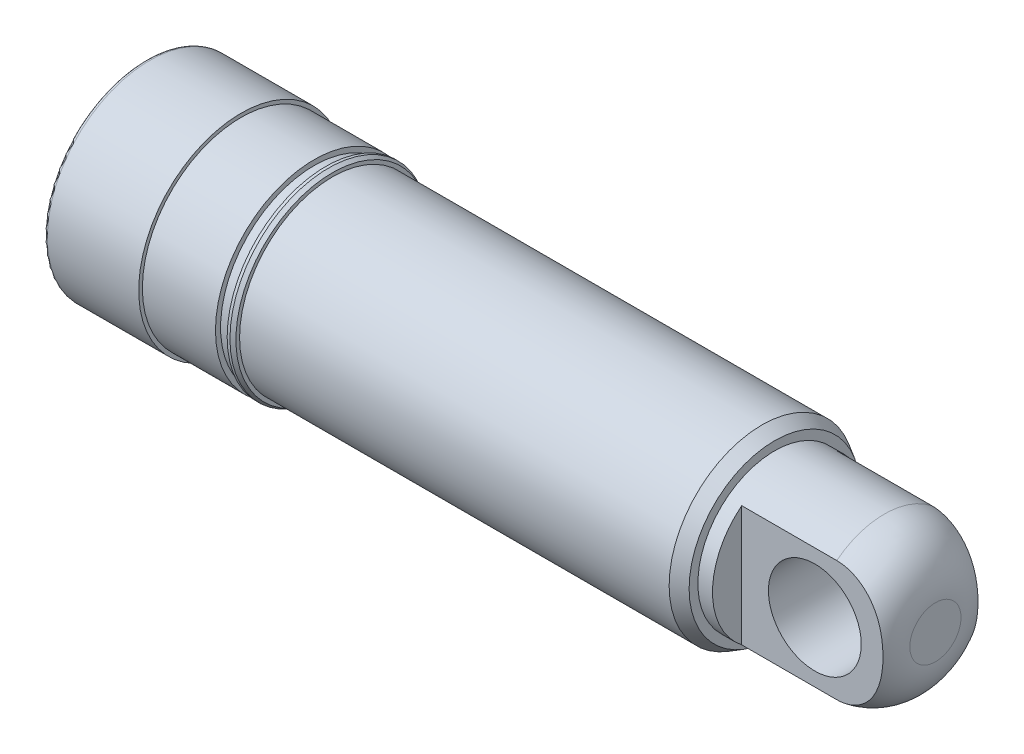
ISO-10303-21;
HEADER;
FILE_DESCRIPTION(('STEP AP214'),'2;1');
FILE_NAME('part.step','',(''),(''),'','','');
FILE_SCHEMA(('AUTOMOTIVE_DESIGN { 1 0 10303 214 1 1 1 1 }'));
ENDSEC;
DATA;
#1=APPLICATION_CONTEXT('core data for automotive mechanical design processes');
#2=APPLICATION_PROTOCOL_DEFINITION('international standard','automotive_design',2000,#1);
#3=PRODUCT_CONTEXT('',#1,'mechanical');
#4=PRODUCT('Part','Part','',(#3));
#5=PRODUCT_RELATED_PRODUCT_CATEGORY('part','',(#4));
#6=PRODUCT_DEFINITION_FORMATION('','',#4);
#7=PRODUCT_DEFINITION_CONTEXT('part definition',#1,'design');
#8=PRODUCT_DEFINITION('design','',#6,#7);
#9=PRODUCT_DEFINITION_SHAPE('','',#8);
#10=(LENGTH_UNIT() NAMED_UNIT(*) SI_UNIT(.MILLI.,.METRE.));
#11=(NAMED_UNIT(*) PLANE_ANGLE_UNIT() SI_UNIT($,.RADIAN.));
#12=(NAMED_UNIT(*) SI_UNIT($,.STERADIAN.) SOLID_ANGLE_UNIT());
#13=UNCERTAINTY_MEASURE_WITH_UNIT(LENGTH_MEASURE(1.E-05),#10,'distance_accuracy_value','');
#14=(GEOMETRIC_REPRESENTATION_CONTEXT(3) GLOBAL_UNCERTAINTY_ASSIGNED_CONTEXT((#13)) GLOBAL_UNIT_ASSIGNED_CONTEXT((#10,
#11,#12)) REPRESENTATION_CONTEXT('',''));
#15=CARTESIAN_POINT('',(0.,0.,0.));
#16=DIRECTION('',(0.,0.,1.));
#17=DIRECTION('',(1.,0.,0.));
#18=AXIS2_PLACEMENT_3D('',#15,#16,#17);
#19=CARTESIAN_POINT('',(64.0000000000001,0.,0.));
#20=DIRECTION('',(-1.,0.,0.));
#21=DIRECTION('',(0.,0.,1.));
#22=AXIS2_PLACEMENT_3D('',#19,#20,#21);
#23=PLANE('',#22);
#24=CARTESIAN_POINT('',(64.0000000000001,0.,0.));
#25=DIRECTION('',(-1.,0.,0.));
#26=DIRECTION('',(0.,0.,1.));
#27=AXIS2_PLACEMENT_3D('',#24,#25,#26);
#28=CIRCLE('',#27,9.);
#29=CARTESIAN_POINT('',(64.0000000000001,0.,9.));
#30=VERTEX_POINT('',#29);
#31=EDGE_CURVE('E231',#30,#30,#28,.T.);
#32=ORIENTED_EDGE('',*,*,#31,.T.);
#33=EDGE_LOOP('',(#32));
#34=FACE_BOUND('',#33,.T.);
#35=ADVANCED_FACE('F14',(#34),#23,.T.);
#36=CARTESIAN_POINT('',(64.0000000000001,0.,0.));
#37=DIRECTION('',(-1.,0.,0.));
#38=DIRECTION('',(0.,0.,1.));
#39=AXIS2_PLACEMENT_3D('',#36,#37,#38);
#40=CYLINDRICAL_SURFACE('',#39,9.);
#41=ORIENTED_EDGE('',*,*,#31,.F.);
#42=EDGE_LOOP('',(#41));
#43=FACE_BOUND('',#42,.T.);
#44=CARTESIAN_POINT('',(-4.99999999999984,0.,0.));
#45=DIRECTION('',(-1.,0.,0.));
#46=DIRECTION('',(0.,0.,1.));
#47=AXIS2_PLACEMENT_3D('',#44,#45,#46);
#48=CIRCLE('',#47,9.);
#49=CARTESIAN_POINT('',(-4.99999999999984,0.,9.));
#50=VERTEX_POINT('',#49);
#51=EDGE_CURVE('E228',#50,#50,#48,.F.);
#52=ORIENTED_EDGE('',*,*,#51,.F.);
#53=EDGE_LOOP('',(#52));
#54=FACE_BOUND('',#53,.T.);
#55=ADVANCED_FACE('F236',(#43,#54),#40,.F.);
#56=CARTESIAN_POINT('',(-4.99999999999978,0.,0.));
#57=DIRECTION('',(-1.,0.,0.));
#58=DIRECTION('',(0.,0.,1.));
#59=AXIS2_PLACEMENT_3D('',#56,#57,#58);
#60=PLANE('',#59);
#61=ORIENTED_EDGE('',*,*,#51,.T.);
#62=EDGE_LOOP('',(#61));
#63=FACE_BOUND('',#62,.T.);
#64=CARTESIAN_POINT('',(-4.99999999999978,0.,0.));
#65=DIRECTION('',(-1.,0.,0.));
#66=DIRECTION('',(0.,0.,1.));
#67=AXIS2_PLACEMENT_3D('',#64,#65,#66);
#68=CIRCLE('',#67,10.);
#69=CARTESIAN_POINT('',(-4.99999999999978,0.,10.));
#70=VERTEX_POINT('',#69);
#71=EDGE_CURVE('E225',#70,#70,#68,.T.);
#72=ORIENTED_EDGE('',*,*,#71,.T.);
#73=EDGE_LOOP('',(#72));
#74=FACE_BOUND('',#73,.T.);
#75=ADVANCED_FACE('F239',(#63,#74),#60,.T.);
#76=CARTESIAN_POINT('',(-4.99999999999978,0.,0.));
#77=DIRECTION('',(-1.,0.,0.));
#78=DIRECTION('',(0.,0.,1.));
#79=AXIS2_PLACEMENT_3D('',#76,#77,#78);
#80=CYLINDRICAL_SURFACE('',#79,10.);
#81=ORIENTED_EDGE('',*,*,#71,.F.);
#82=EDGE_LOOP('',(#81));
#83=FACE_BOUND('',#82,.T.);
#84=CARTESIAN_POINT('',(-13.,0.,0.));
#85=DIRECTION('',(-1.,0.,0.));
#86=DIRECTION('',(0.,0.,1.));
#87=AXIS2_PLACEMENT_3D('',#84,#85,#86);
#88=CIRCLE('',#87,10.);
#89=CARTESIAN_POINT('',(-13.,0.,10.));
#90=VERTEX_POINT('',#89);
#91=EDGE_CURVE('E80',#90,#90,#88,.T.);
#92=ORIENTED_EDGE('',*,*,#91,.T.);
#93=EDGE_LOOP('',(#92));
#94=FACE_BOUND('',#93,.T.);
#95=ADVANCED_FACE('F245',(#83,#94),#80,.F.);
#96=CARTESIAN_POINT('',(-13.,0.,0.));
#97=DIRECTION('',(1.,0.,0.));
#98=DIRECTION('',(0.,0.,-1.));
#99=AXIS2_PLACEMENT_3D('',#96,#97,#98);
#100=PLANE('',#99);
#101=ORIENTED_EDGE('',*,*,#91,.F.);
#102=EDGE_LOOP('',(#101));
#103=FACE_BOUND('',#102,.T.);
#104=CARTESIAN_POINT('',(-12.9999999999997,0.,0.));
#105=DIRECTION('',(1.,0.,0.));
#106=DIRECTION('',(0.,-1.,0.));
#107=AXIS2_PLACEMENT_3D('',#104,#105,#106);
#108=CIRCLE('',#107,13.499999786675);
#109=CARTESIAN_POINT('',(-12.9999999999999,-13.49999965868,0.));
#110=VERTEX_POINT('',#109);
#111=CARTESIAN_POINT('',(-13.,13.49999965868,0.));
#112=VERTEX_POINT('',#111);
#113=EDGE_CURVE('E78',#110,#112,#108,.T.);
#114=ORIENTED_EDGE('',*,*,#113,.F.);
#115=CARTESIAN_POINT('',(-12.9999999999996,0.,0.));
#116=DIRECTION('',(1.,0.,0.));
#117=DIRECTION('',(0.,1.,0.));
#118=AXIS2_PLACEMENT_3D('',#115,#116,#117);
#119=CIRCLE('',#118,13.49999957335);
#120=EDGE_CURVE('E73',#112,#110,#119,.T.);
#121=ORIENTED_EDGE('',*,*,#120,.F.);
#122=EDGE_LOOP('',(#114,#121));
#123=FACE_BOUND('',#122,.T.);
#124=ADVANCED_FACE('F77',(#103,#123),#100,.F.);
#125=CARTESIAN_POINT('',(-12.4999999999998,0.,0.));
#126=DIRECTION('',(1.,0.,0.));
#127=DIRECTION('',(0.,0.999838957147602,0.01794602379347));
#128=AXIS2_PLACEMENT_3D('',#125,#126,#127);
#129=TOROIDAL_SURFACE('',#128,13.5,0.5);
#130=CARTESIAN_POINT('',(-12.5,0.,0.));
#131=DIRECTION('',(1.,0.,0.));
#132=DIRECTION('',(0.,-1.,0.));
#133=AXIS2_PLACEMENT_3D('',#130,#131,#132);
#134=CIRCLE('',#133,14.);
#135=CARTESIAN_POINT('',(-12.5,-14.,0.));
#136=VERTEX_POINT('',#135);
#137=EDGE_CURVE('E85',#136,#136,#134,.T.);
#138=ORIENTED_EDGE('',*,*,#137,.F.);
#139=EDGE_LOOP('',(#138));
#140=FACE_BOUND('',#139,.T.);
#141=ORIENTED_EDGE('',*,*,#113,.T.);
#142=ORIENTED_EDGE('',*,*,#120,.T.);
#143=EDGE_LOOP('',(#141,#142));
#144=FACE_BOUND('',#143,.T.);
#145=ADVANCED_FACE('F84',(#140,#144),#129,.T.);
#146=CARTESIAN_POINT('',(-12.5,0.,0.));
#147=DIRECTION('',(1.,0.,0.));
#148=DIRECTION('',(0.,0.,-1.));
#149=AXIS2_PLACEMENT_3D('',#146,#147,#148);
#150=CYLINDRICAL_SURFACE('',#149,14.);
#151=CARTESIAN_POINT('',(0.,0.,0.));
#152=DIRECTION('',(1.,0.,0.));
#153=DIRECTION('',(0.,0.,-1.));
#154=AXIS2_PLACEMENT_3D('',#151,#152,#153);
#155=CIRCLE('',#154,14.);
#156=CARTESIAN_POINT('',(0.,0.,-14.));
#157=VERTEX_POINT('',#156);
#158=EDGE_CURVE('E220',#157,#157,#155,.T.);
#159=ORIENTED_EDGE('',*,*,#158,.F.);
#160=EDGE_LOOP('',(#159));
#161=FACE_BOUND('',#160,.T.);
#162=ORIENTED_EDGE('',*,*,#137,.T.);
#163=EDGE_LOOP('',(#162));
#164=FACE_BOUND('',#163,.T.);
#165=ADVANCED_FACE('F104',(#161,#164),#150,.T.);
#166=CARTESIAN_POINT('',(0.,0.,0.));
#167=DIRECTION('',(1.,0.,0.));
#168=DIRECTION('',(0.,0.,-1.));
#169=AXIS2_PLACEMENT_3D('',#166,#167,#168);
#170=PLANE('',#169);
#171=CARTESIAN_POINT('',(0.,0.,0.));
#172=DIRECTION('',(1.,0.,0.));
#173=DIRECTION('',(0.,0.,-1.));
#174=AXIS2_PLACEMENT_3D('',#171,#172,#173);
#175=CIRCLE('',#174,13.5);
#176=CARTESIAN_POINT('',(0.,0.,-13.5));
#177=VERTEX_POINT('',#176);
#178=EDGE_CURVE('E217',#177,#177,#175,.T.);
#179=ORIENTED_EDGE('',*,*,#178,.F.);
#180=EDGE_LOOP('',(#179));
#181=FACE_BOUND('',#180,.T.);
#182=ORIENTED_EDGE('',*,*,#158,.T.);
#183=EDGE_LOOP('',(#182));
#184=FACE_BOUND('',#183,.T.);
#185=ADVANCED_FACE('F275',(#181,#184),#170,.T.);
#186=CARTESIAN_POINT('',(0.,0.,0.));
#187=DIRECTION('',(1.,0.,0.));
#188=DIRECTION('',(0.,0.,-1.));
#189=AXIS2_PLACEMENT_3D('',#186,#187,#188);
#190=CYLINDRICAL_SURFACE('',#189,13.5);
#191=ORIENTED_EDGE('',*,*,#178,.T.);
#192=EDGE_LOOP('',(#191));
#193=FACE_BOUND('',#192,.T.);
#194=CARTESIAN_POINT('',(10.0000000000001,0.,0.));
#195=DIRECTION('',(1.,0.,0.));
#196=DIRECTION('',(0.,0.,-1.));
#197=AXIS2_PLACEMENT_3D('',#194,#195,#196);
#198=CIRCLE('',#197,13.5);
#199=CARTESIAN_POINT('',(10.0000000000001,0.,-13.5));
#200=VERTEX_POINT('',#199);
#201=EDGE_CURVE('E214',#200,#200,#198,.T.);
#202=ORIENTED_EDGE('',*,*,#201,.F.);
#203=EDGE_LOOP('',(#202));
#204=FACE_BOUND('',#203,.T.);
#205=ADVANCED_FACE('F283',(#193,#204),#190,.T.);
#206=CARTESIAN_POINT('',(10.0000000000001,0.,0.));
#207=DIRECTION('',(1.,0.,0.));
#208=DIRECTION('',(0.,0.,-1.));
#209=AXIS2_PLACEMENT_3D('',#206,#207,#208);
#210=PLANE('',#209);
#211=CARTESIAN_POINT('',(10.0000000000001,0.,0.));
#212=DIRECTION('',(1.,0.,0.));
#213=DIRECTION('',(0.,0.,-1.));
#214=AXIS2_PLACEMENT_3D('',#211,#212,#213);
#215=CIRCLE('',#214,12.8);
#216=CARTESIAN_POINT('',(10.0000000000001,0.,-12.8));
#217=VERTEX_POINT('',#216);
#218=EDGE_CURVE('E211',#217,#217,#215,.T.);
#219=ORIENTED_EDGE('',*,*,#218,.F.);
#220=EDGE_LOOP('',(#219));
#221=FACE_BOUND('',#220,.T.);
#222=ORIENTED_EDGE('',*,*,#201,.T.);
#223=EDGE_LOOP('',(#222));
#224=FACE_BOUND('',#223,.T.);
#225=ADVANCED_FACE('F291',(#221,#224),#210,.T.);
#226=CARTESIAN_POINT('',(10.0000000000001,0.,0.));
#227=DIRECTION('',(1.,0.,0.));
#228=DIRECTION('',(0.,0.,-1.));
#229=AXIS2_PLACEMENT_3D('',#226,#227,#228);
#230=CYLINDRICAL_SURFACE('',#229,12.8);
#231=ORIENTED_EDGE('',*,*,#218,.T.);
#232=EDGE_LOOP('',(#231));
#233=FACE_BOUND('',#232,.T.);
#234=CARTESIAN_POINT('',(11.6000000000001,0.,0.));
#235=DIRECTION('',(1.,0.,0.));
#236=DIRECTION('',(0.,0.,-1.));
#237=AXIS2_PLACEMENT_3D('',#234,#235,#236);
#238=CIRCLE('',#237,12.8);
#239=CARTESIAN_POINT('',(11.6000000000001,0.,-12.8));
#240=VERTEX_POINT('',#239);
#241=EDGE_CURVE('E208',#240,#240,#238,.F.);
#242=ORIENTED_EDGE('',*,*,#241,.T.);
#243=EDGE_LOOP('',(#242));
#244=FACE_BOUND('',#243,.T.);
#245=ADVANCED_FACE('F300',(#233,#244),#230,.T.);
#246=CARTESIAN_POINT('',(95.0000000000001,0.,0.));
#247=DIRECTION('',(1.,0.,0.));
#248=DIRECTION('',(0.,0.,-1.));
#249=AXIS2_PLACEMENT_3D('',#246,#247,#248);
#250=PLANE('',#249);
#251=CARTESIAN_POINT('',(94.9999999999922,-3.499999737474,0.));
#252=CARTESIAN_POINT('',(94.9999999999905,-3.49999300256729,0.048826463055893));
#253=CARTESIAN_POINT('',(94.99999999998,-3.49896451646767,0.0976527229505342));
#254=CARTESIAN_POINT('',(94.9999999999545,-3.49486864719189,0.195219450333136));
#255=CARTESIAN_POINT('',(94.9999999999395,-3.49180127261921,0.243959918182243));
#256=CARTESIAN_POINT('',(94.9999999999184,-3.48363224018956,0.341269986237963));
#257=CARTESIAN_POINT('',(94.9999999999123,-3.47853058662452,0.389839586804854));
#258=CARTESIAN_POINT('',(94.9999999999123,-3.4663021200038,0.486723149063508));
#259=CARTESIAN_POINT('',(94.9999999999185,-3.45917530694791,0.535037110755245));
#260=CARTESIAN_POINT('',(94.9999999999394,-3.44290886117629,0.631325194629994));
#261=CARTESIAN_POINT('',(94.9999999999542,-3.43376922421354,0.679299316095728));
#262=CARTESIAN_POINT('',(94.9999999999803,-3.41349324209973,0.77482360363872));
#263=CARTESIAN_POINT('',(94.9999999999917,-3.40235688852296,0.822373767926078));
#264=CARTESIAN_POINT('',(94.9999999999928,-3.376720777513,0.922373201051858));
#265=CARTESIAN_POINT('',(94.99999999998,-3.36198209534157,0.974761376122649));
#266=CARTESIAN_POINT('',(94.9999999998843,-3.33008158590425,1.07879541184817));
#267=CARTESIAN_POINT('',(94.9999999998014,-3.31291973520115,1.13044126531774));
#268=CARTESIAN_POINT('',(94.9999999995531,-3.27879541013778,1.22565926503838));
#269=CARTESIAN_POINT('',(94.9999999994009,-3.26214552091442,1.26934372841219));
#270=CARTESIAN_POINT('',(94.9999999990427,-3.22710870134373,1.35601103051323));
#271=CARTESIAN_POINT('',(94.9999999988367,-3.20872175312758,1.39899386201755));
#272=CARTESIAN_POINT('',(94.9999999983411,-3.16775776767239,1.48968577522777));
#273=CARTESIAN_POINT('',(94.9999999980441,-3.14494619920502,1.53728911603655));
#274=CARTESIAN_POINT('',(94.9999999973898,-3.0971934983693,1.63141557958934));
#275=CARTESIAN_POINT('',(94.9999999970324,-3.07225234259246,1.67793869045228));
#276=CARTESIAN_POINT('',(94.9999999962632,-3.02029129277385,1.76980998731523));
#277=CARTESIAN_POINT('',(94.9999999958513,-2.99327137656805,1.81515816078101));
#278=CARTESIAN_POINT('',(94.9999999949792,-2.93720810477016,1.90458660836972));
#279=CARTESIAN_POINT('',(94.999999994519,-2.90816472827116,1.94866686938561));
#280=CARTESIAN_POINT('',(94.9999999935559,-2.84811392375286,2.03546928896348));
#281=CARTESIAN_POINT('',(94.9999999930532,-2.81710647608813,2.07819143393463));
#282=CARTESIAN_POINT('',(94.9999999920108,-2.75319094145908,2.16219015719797));
#283=CARTESIAN_POINT('',(94.9999999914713,-2.72028283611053,2.20346672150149));
#284=CARTESIAN_POINT('',(94.9999999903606,-2.65263333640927,2.28448975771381));
#285=CARTESIAN_POINT('',(94.9999999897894,-2.61789192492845,2.32423621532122));
#286=CARTESIAN_POINT('',(94.999999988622,-2.54664673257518,2.40211775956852));
#287=CARTESIAN_POINT('',(94.9999999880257,-2.51014293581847,2.44025283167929));
#288=CARTESIAN_POINT('',(94.9999999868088,-2.43544819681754,2.51483317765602));
#289=CARTESIAN_POINT('',(94.9999999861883,-2.39725723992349,2.55127843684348));
#290=CARTESIAN_POINT('',(94.9999999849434,-2.31926426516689,2.62240585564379));
#291=CARTESIAN_POINT('',(94.9999999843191,-2.27946223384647,2.65708800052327));
#292=CARTESIAN_POINT('',(94.9999999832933,-2.21571911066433,2.71014458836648));
#293=CARTESIAN_POINT('',(94.9999999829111,-2.19229038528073,2.72913834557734));
#294=CARTESIAN_POINT('',(94.9999999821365,-2.13935352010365,2.77093070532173));
#295=CARTESIAN_POINT('',(94.9999999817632,-2.10971725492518,2.7935675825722));
#296=CARTESIAN_POINT('',(94.9999999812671,-2.04973535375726,2.8378794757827));
#297=CARTESIAN_POINT('',(94.9999999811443,-2.01938971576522,2.85955448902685));
#298=CARTESIAN_POINT('',(94.9999999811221,-1.94574509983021,2.91039494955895));
#299=CARTESIAN_POINT('',(94.9999999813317,-1.90211943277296,2.9390891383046));
#300=CARTESIAN_POINT('',(94.9999999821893,-1.81362652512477,2.99449148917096));
#301=CARTESIAN_POINT('',(94.9999999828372,-1.76875929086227,3.02119966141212));
#302=CARTESIAN_POINT('',(94.9999999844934,-1.67787238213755,3.07257730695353));
#303=CARTESIAN_POINT('',(94.9999999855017,-1.63185271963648,3.09724680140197));
#304=CARTESIAN_POINT('',(94.9999999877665,-1.53875478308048,3.1444963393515));
#305=CARTESIAN_POINT('',(94.999999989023,-1.49167652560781,3.16707641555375));
#306=CARTESIAN_POINT('',(94.9999999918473,-1.38684985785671,3.21449413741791));
#307=CARTESIAN_POINT('',(94.9999999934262,-1.32888401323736,3.23885257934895));
#308=CARTESIAN_POINT('',(94.9999999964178,-1.21172017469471,3.28439742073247));
#309=CARTESIAN_POINT('',(94.9999999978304,-1.15252222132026,3.30558392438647));
#310=CARTESIAN_POINT('',(94.9999999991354,-1.05597692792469,3.33724541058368));
#311=CARTESIAN_POINT('',(94.9999999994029,-1.01895193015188,3.34871333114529));
#312=CARTESIAN_POINT('',(94.9999999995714,-0.944548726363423,3.37043986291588));
#313=CARTESIAN_POINT('',(94.9999999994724,-0.907170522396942,3.3806984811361));
#314=CARTESIAN_POINT('',(94.9999999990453,-0.814773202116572,3.4044390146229));
#315=CARTESIAN_POINT('',(94.9999999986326,-0.759573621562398,3.41722360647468));
#316=CARTESIAN_POINT('',(94.9999999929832,-0.648626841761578,3.44016282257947));
#317=CARTESIAN_POINT('',(94.9999999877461,-0.592879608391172,3.45031728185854));
#318=CARTESIAN_POINT('',(94.9999999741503,-0.496424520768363,3.46547081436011));
#319=CARTESIAN_POINT('',(94.9999999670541,-0.455817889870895,3.47111909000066));
#320=CARTESIAN_POINT('',(94.999999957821,-0.374423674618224,3.48093123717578));
#321=CARTESIAN_POINT('',(94.9999999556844,-0.333636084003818,3.48509505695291));
#322=CARTESIAN_POINT('',(94.9999999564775,-0.24396676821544,3.49261178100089));
#323=CARTESIAN_POINT('',(94.999999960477,-0.195058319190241,3.49564801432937));
#324=CARTESIAN_POINT('',(94.9999999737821,-0.0971576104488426,3.4996077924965));
#325=CARTESIAN_POINT('',(94.9999999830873,-0.0481653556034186,3.50053145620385));
#326=CARTESIAN_POINT('',(94.9999999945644,0.0368097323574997,3.50026774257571));
#327=CARTESIAN_POINT('',(94.9999999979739,0.072795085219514,3.49957548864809));
#328=CARTESIAN_POINT('',(95.000000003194,0.170622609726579,3.49623403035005));
#329=CARTESIAN_POINT('',(95.0000000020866,0.232429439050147,3.49253478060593));
#330=CARTESIAN_POINT('',(94.9999999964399,0.339905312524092,3.4837508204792));
#331=CARTESIAN_POINT('',(94.9999999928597,0.385624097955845,3.47926973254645));
#332=CARTESIAN_POINT('',(94.9999999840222,0.462485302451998,3.46997094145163));
#333=CARTESIAN_POINT('',(94.9999999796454,0.493694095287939,3.46570140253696));
#334=CARTESIAN_POINT('',(94.9999999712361,0.59962477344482,3.44970100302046));
#335=CARTESIAN_POINT('',(94.999999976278,0.674048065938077,3.43589747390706));
#336=CARTESIAN_POINT('',(94.9999999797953,0.769764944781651,3.41492218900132));
#337=CARTESIAN_POINT('',(94.9999999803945,0.791557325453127,3.40992765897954));
#338=CARTESIAN_POINT('',(94.9999999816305,0.835042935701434,3.39952209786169));
#339=CARTESIAN_POINT('',(94.9999999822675,0.856736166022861,3.3941110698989));
#340=CARTESIAN_POINT('',(94.9999999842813,0.928865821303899,3.37538404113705));
#341=CARTESIAN_POINT('',(94.9999999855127,0.979066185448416,3.36114646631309));
#342=CARTESIAN_POINT('',(94.9999999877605,1.07877815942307,3.33044414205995));
#343=CARTESIAN_POINT('',(94.9999999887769,1.1282897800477,3.31397942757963));
#344=CARTESIAN_POINT('',(94.9999999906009,1.22652805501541,3.27885515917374));
#345=CARTESIAN_POINT('',(94.9999999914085,1.27525472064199,3.26019563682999));
#346=CARTESIAN_POINT('',(94.9999999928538,1.37182524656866,3.22071918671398));
#347=CARTESIAN_POINT('',(94.9999999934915,1.4196691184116,3.1999022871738));
#348=CARTESIAN_POINT('',(94.9999999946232,1.51437883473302,3.15615261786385));
#349=CARTESIAN_POINT('',(94.9999999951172,1.56124469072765,3.13321987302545));
#350=CARTESIAN_POINT('',(94.9999999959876,1.65390487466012,3.0852843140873));
#351=CARTESIAN_POINT('',(94.9999999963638,1.69969921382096,3.06028152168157));
#352=CARTESIAN_POINT('',(94.9999999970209,1.79012506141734,3.00825577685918));
#353=CARTESIAN_POINT('',(94.9999999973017,1.83475658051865,2.98123284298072));
#354=CARTESIAN_POINT('',(94.9999999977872,1.9227677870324,2.92522075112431));
#355=CARTESIAN_POINT('',(94.999999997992,1.96614748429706,2.89623160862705));
#356=CARTESIAN_POINT('',(94.9999999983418,2.05156854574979,2.83634494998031));
#357=CARTESIAN_POINT('',(94.999999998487,2.0936099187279,2.80544744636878));
#358=CARTESIAN_POINT('',(94.9999999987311,2.17627049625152,2.74180571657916));
#359=CARTESIAN_POINT('',(94.9999999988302,2.2168897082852,2.70906150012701));
#360=CARTESIAN_POINT('',(94.9999999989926,2.29662496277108,2.64179167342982));
#361=CARTESIAN_POINT('',(94.999999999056,2.33574101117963,2.60726607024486));
#362=CARTESIAN_POINT('',(94.9999999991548,2.41239193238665,2.53650234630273));
#363=CARTESIAN_POINT('',(94.9999999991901,2.44992680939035,2.50026423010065));
#364=CARTESIAN_POINT('',(94.9999999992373,2.52334053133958,2.42614776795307));
#365=CARTESIAN_POINT('',(94.9999999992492,2.55921937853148,2.38826942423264));
#366=CARTESIAN_POINT('',(94.999999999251,2.62924948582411,2.31094805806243));
#367=CARTESIAN_POINT('',(94.999999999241,2.6634007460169,2.27150503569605));
#368=CARTESIAN_POINT('',(94.9999999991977,2.72990755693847,2.19113299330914));
#369=CARTESIAN_POINT('',(94.9999999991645,2.76226310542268,2.15020397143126));
#370=CARTESIAN_POINT('',(94.9999999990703,2.82511398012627,2.0669415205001));
#371=CARTESIAN_POINT('',(94.9999999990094,2.85560930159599,2.02460808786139));
#372=CARTESIAN_POINT('',(94.9999999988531,2.91467879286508,1.93862139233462));
#373=CARTESIAN_POINT('',(94.9999999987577,2.94325295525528,1.89496812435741));
#374=CARTESIAN_POINT('',(94.9999999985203,2.99842348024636,1.80642826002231));
#375=CARTESIAN_POINT('',(94.9999999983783,3.02501983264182,1.76154165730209));
#376=CARTESIAN_POINT('',(94.9999999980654,3.07252647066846,1.67711981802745));
#377=CARTESIAN_POINT('',(94.9999999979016,3.09370631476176,1.63773597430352));
#378=CARTESIAN_POINT('',(94.9999999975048,3.13454322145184,1.55818646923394));
#379=CARTESIAN_POINT('',(94.9999999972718,3.15420027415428,1.51802080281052));
#380=CARTESIAN_POINT('',(94.9999999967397,3.19693617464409,1.42628388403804));
#381=CARTESIAN_POINT('',(94.9999999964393,3.21955181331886,1.37449607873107));
#382=CARTESIAN_POINT('',(94.9999999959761,3.26224538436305,1.26988482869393));
#383=CARTESIAN_POINT('',(94.9999999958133,3.28232330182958,1.217061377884));
#384=CARTESIAN_POINT('',(94.9999999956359,3.31754684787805,1.11716400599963));
#385=CARTESIAN_POINT('',(94.9999999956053,3.3329952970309,1.07019659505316));
#386=CARTESIAN_POINT('',(94.9999999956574,3.36188611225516,0.975648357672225));
#387=CARTESIAN_POINT('',(94.9999999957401,3.3753284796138,0.928067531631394));
#388=CARTESIAN_POINT('',(94.9999999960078,3.40018274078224,0.83237877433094));
#389=CARTESIAN_POINT('',(94.9999999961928,3.41159464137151,0.784270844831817));
#390=CARTESIAN_POINT('',(94.9999999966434,3.43236745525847,0.687614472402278));
#391=CARTESIAN_POINT('',(94.9999999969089,3.44172838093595,0.639066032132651));
#392=CARTESIAN_POINT('',(94.9999999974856,3.45838236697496,0.541616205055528));
#393=CARTESIAN_POINT('',(94.9999999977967,3.46567544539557,0.492714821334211));
#394=CARTESIAN_POINT('',(94.9999999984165,3.47818068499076,0.394647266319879));
#395=CARTESIAN_POINT('',(94.9999999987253,3.48339286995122,0.345481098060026));
#396=CARTESIAN_POINT('',(94.9999999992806,3.49172675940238,0.246972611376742));
#397=CARTESIAN_POINT('',(94.9999999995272,3.49484849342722,0.197630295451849));
#398=CARTESIAN_POINT('',(94.9999999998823,3.49899670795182,0.0988585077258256));
#399=CARTESIAN_POINT('',(94.9999999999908,3.50002322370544,0.0494290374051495));
#400=CARTESIAN_POINT('',(94.9999999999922,3.499999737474,0.));
#401=B_SPLINE_CURVE_WITH_KNOTS('',3,(#251,#252,#253,#254,#255,#256,#257,#258,#259,#260,#261,
#262,#263,#264,#265,#266,#267,#268,#269,#270,#271,#272,#273,#274,#275,#276,#277,#278,#279,#280,
#281,#282,#283,#284,#285,#286,#287,#288,#289,#290,#291,#292,#293,#294,#295,#296,#297,#298,#299,
#300,#301,#302,#303,#304,#305,#306,#307,#308,#309,#310,#311,#312,#313,#314,#315,#316,#317,#318,
#319,#320,#321,#322,#323,#324,#325,#326,#327,#328,#329,#330,#331,#332,#333,#334,#335,#336,#337,
#338,#339,#340,#341,#342,#343,#344,#345,#346,#347,#348,#349,#350,#351,#352,#353,#354,#355,#356,
#357,#358,#359,#360,#361,#362,#363,#364,#365,#366,#367,#368,#369,#370,#371,#372,#373,#374,#375,
#376,#377,#378,#379,#380,#381,#382,#383,#384,#385,#386,#387,#388,#389,#390,#391,#392,#393,#394,
#395,#396,#397,#398,#399,#400),.UNSPECIFIED.,.F.,.F.,(4,2,2,2,2,2,2,2,2,2,2,2,2,2,2,2,2,2,2,2,2,
2,2,2,2,2,2,2,2,2,2,2,2,2,2,2,2,2,2,2,2,2,2,2,2,2,2,2,2,2,2,2,2,2,2,2,2,2,2,2,2,2,2,2,2,2,2,2,2,
2,2,2,2,2,4),(0.,0.146468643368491,0.292936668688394,0.439404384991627,0.585872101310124,
0.732340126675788,0.87880877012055,1.04201492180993,1.20522265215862,1.34543559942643,
1.48564998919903,1.64395533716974,1.80226242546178,1.96057120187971,2.11888161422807,
2.27719361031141,2.43550713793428,2.59382214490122,2.75213857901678,2.91045638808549,
3.06877551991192,3.15924936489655,3.27110642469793,3.38296380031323,3.53955765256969,
3.69615070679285,3.85274213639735,4.00933111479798,4.19786549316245,4.38639367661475,
4.50265592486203,4.61891749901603,4.7888332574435,4.95875967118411,5.08172716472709,
5.20469894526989,5.35166098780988,5.4986147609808,5.60657485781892,5.79225559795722,
5.93003427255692,6.02452204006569,6.25139531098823,6.31846576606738,6.38553571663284,
6.54201977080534,6.69850136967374,6.85498071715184,7.01145801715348,7.16793347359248,
7.32440729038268,7.48087967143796,7.63735082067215,7.79382094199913,7.95029023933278,
8.10675891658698,8.2632271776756,8.41969522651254,8.57616326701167,8.73263150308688,
8.88910013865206,9.0455693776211,9.20203942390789,9.33616036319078,9.4702821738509,
9.63974544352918,9.80920970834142,9.95749469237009,10.1057795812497,10.2540639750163,
10.4023474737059,10.5506296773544,10.698910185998,10.8471885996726,10.9954645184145),.UNSPECIFIED.);
#402=CARTESIAN_POINT('',(94.9999999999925,-3.49999980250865,3.93747188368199E-06));
#403=VERTEX_POINT('',#402);
#404=CARTESIAN_POINT('',(94.9999999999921,3.49999973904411,3.40964601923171E-06));
#405=VERTEX_POINT('',#404);
#406=EDGE_CURVE('E65',#403,#405,#401,.T.);
#407=ORIENTED_EDGE('',*,*,#406,.F.);
#408=CARTESIAN_POINT('',(94.9999999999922,3.499999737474,0.));
#409=CARTESIAN_POINT('',(94.9999999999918,3.499994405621,-0.0366487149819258));
#410=CARTESIAN_POINT('',(94.9999999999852,3.49941350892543,-0.0732973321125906));
#411=CARTESIAN_POINT('',(94.9999999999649,3.49710205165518,-0.146558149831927));
#412=CARTESIAN_POINT('',(94.9999999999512,3.49537149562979,-0.183170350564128));
#413=CARTESIAN_POINT('',(94.9999999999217,3.49076219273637,-0.256322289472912));
#414=CARTESIAN_POINT('',(94.999999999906,3.48788344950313,-0.29286202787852));
#415=CARTESIAN_POINT('',(94.9999999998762,3.4809806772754,-0.365833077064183));
#416=CARTESIAN_POINT('',(94.9999999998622,3.47695665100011,-0.402264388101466));
#417=CARTESIAN_POINT('',(94.9999999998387,3.46776726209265,-0.474982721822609));
#418=CARTESIAN_POINT('',(94.9999999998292,3.46260190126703,-0.511269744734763));
#419=CARTESIAN_POINT('',(94.9999999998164,3.45113493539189,-0.583663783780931));
#420=CARTESIAN_POINT('',(94.9999999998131,3.44483333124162,-0.619770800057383));
#421=CARTESIAN_POINT('',(94.9999999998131,3.43110008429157,-0.69176928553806));
#422=CARTESIAN_POINT('',(94.9999999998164,3.42366844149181,-0.727660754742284));
#423=CARTESIAN_POINT('',(94.9999999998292,3.40768242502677,-0.799192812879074));
#424=CARTESIAN_POINT('',(94.9999999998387,3.39912805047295,-0.834833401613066));
#425=CARTESIAN_POINT('',(94.9999999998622,3.38090501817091,-0.905828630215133));
#426=CARTESIAN_POINT('',(94.9999999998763,3.37123635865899,-0.941183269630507));
#427=CARTESIAN_POINT('',(94.9999999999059,3.35079416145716,-1.01157174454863));
#428=CARTESIAN_POINT('',(94.9999999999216,3.34002062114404,-1.04660557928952));
#429=CARTESIAN_POINT('',(94.9999999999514,3.31737966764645,-1.1163181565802));
#430=CARTESIAN_POINT('',(94.9999999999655,3.30551225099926,-1.15099689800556));
#431=CARTESIAN_POINT('',(94.9999999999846,3.28069370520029,-1.21996441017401));
#432=CARTESIAN_POINT('',(94.9999999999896,3.26774257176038,-1.25425317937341));
#433=CARTESIAN_POINT('',(94.999999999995,3.23964349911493,-1.32526941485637));
#434=CARTESIAN_POINT('',(94.9999999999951,3.22440241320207,-1.36196005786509));
#435=CARTESIAN_POINT('',(94.999999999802,3.19269238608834,-1.43480738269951));
#436=CARTESIAN_POINT('',(94.9999999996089,3.1762234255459,-1.47096405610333));
#437=CARTESIAN_POINT('',(94.9999999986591,3.14207428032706,-1.54270203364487));
#438=CARTESIAN_POINT('',(94.9999999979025,3.12439406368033,-1.57828332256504));
#439=CARTESIAN_POINT('',(94.9999999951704,3.08784329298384,-1.64883086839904));
#440=CARTESIAN_POINT('',(94.9999999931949,3.06897269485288,-1.68379710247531));
#441=CARTESIAN_POINT('',(94.9999999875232,3.03006018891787,-1.75307372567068));
#442=CARTESIAN_POINT('',(94.9999999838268,3.01001822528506,-1.7873840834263));
#443=CARTESIAN_POINT('',(94.999999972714,2.9687931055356,-1.85531506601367));
#444=CARTESIAN_POINT('',(94.9999999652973,2.94760988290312,-1.88893565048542));
#445=CARTESIAN_POINT('',(94.9999999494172,2.90411426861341,-1.95540554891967));
#446=CARTESIAN_POINT('',(94.9999999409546,2.88180267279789,-1.9882553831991));
#447=CARTESIAN_POINT('',(94.9999999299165,2.83603509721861,-2.05314955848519));
#448=CARTESIAN_POINT('',(94.9999999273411,2.81257908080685,-2.08519387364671));
#449=CARTESIAN_POINT('',(94.9999999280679,2.76456102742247,-2.14844287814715));
#450=CARTESIAN_POINT('',(94.9999999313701,2.73999899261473,-2.17964756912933));
#451=CARTESIAN_POINT('',(94.999999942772,2.68979306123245,-2.2411715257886));
#452=CARTESIAN_POINT('',(94.9999999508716,2.66414920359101,-2.27149082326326));
#453=CARTESIAN_POINT('',(94.9999999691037,2.61183068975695,-2.33122499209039));
#454=CARTESIAN_POINT('',(94.9999999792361,2.58515610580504,-2.3606399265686));
#455=CARTESIAN_POINT('',(94.9999999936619,2.53074238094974,-2.41845786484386));
#456=CARTESIAN_POINT('',(94.999999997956,2.50300335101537,-2.44686097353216));
#457=CARTESIAN_POINT('',(95.0000000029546,2.43394685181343,-2.51562968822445));
#458=CARTESIAN_POINT('',(95.0000000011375,2.39219296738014,-2.55555914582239));
#459=CARTESIAN_POINT('',(94.9999999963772,2.3035169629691,-2.63616418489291));
#460=CARTESIAN_POINT('',(94.9999999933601,2.25644184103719,-2.67667232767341));
#461=CARTESIAN_POINT('',(94.9999999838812,2.1738439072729,-2.74403488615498));
#462=CARTESIAN_POINT('',(94.9999999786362,2.13882290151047,-2.77150849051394));
#463=CARTESIAN_POINT('',(94.9999999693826,2.07172817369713,-2.82207465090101));
#464=CARTESIAN_POINT('',(94.9999999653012,2.03976446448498,-2.84531296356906));
#465=CARTESIAN_POINT('',(94.999999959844,1.97914442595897,-2.8878070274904));
#466=CARTESIAN_POINT('',(94.9999999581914,1.95058057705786,-2.9071949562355));
#467=CARTESIAN_POINT('',(94.9999999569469,1.88854813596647,-2.9479479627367));
#468=CARTESIAN_POINT('',(94.9999999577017,1.85498718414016,-2.96917268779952));
#469=CARTESIAN_POINT('',(94.99999996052,1.78715703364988,-3.01045695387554));
#470=CARTESIAN_POINT('',(94.9999999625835,1.75288784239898,-3.03051650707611));
#471=CARTESIAN_POINT('',(94.9999999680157,1.68368005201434,-3.06944388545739));
#472=CARTESIAN_POINT('',(94.9999999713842,1.64874146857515,-3.08831173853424));
#473=CARTESIAN_POINT('',(94.9999999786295,1.57823707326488,-3.12483328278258));
#474=CARTESIAN_POINT('',(94.9999999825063,1.54267128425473,-3.14248701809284));
#475=CARTESIAN_POINT('',(94.9999999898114,1.47095594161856,-3.1765614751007));
#476=CARTESIAN_POINT('',(94.9999999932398,1.43480641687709,-3.19298225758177));
#477=CARTESIAN_POINT('',(94.9999999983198,1.36196317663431,-3.22456242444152));
#478=CARTESIAN_POINT('',(94.9999999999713,1.32526949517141,-3.23972188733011));
#479=CARTESIAN_POINT('',(95.0000000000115,1.25421549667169,-3.26768505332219));
#480=CARTESIAN_POINT('',(94.9999999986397,1.21989110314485,-3.28058025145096));
#481=CARTESIAN_POINT('',(94.9999999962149,1.15086990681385,-3.30532792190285));
#482=CARTESIAN_POINT('',(94.9999999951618,1.11617311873,-3.31718043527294));
#483=CARTESIAN_POINT('',(94.999999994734,1.04643471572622,-3.33982240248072));
#484=CARTESIAN_POINT('',(94.9999999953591,1.01139310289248,-3.35061186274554));
#485=CARTESIAN_POINT('',(94.9999999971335,0.940998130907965,-3.37112575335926));
#486=CARTESIAN_POINT('',(94.9999999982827,0.905644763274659,-3.38085015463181));
#487=CARTESIAN_POINT('',(95.000000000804,0.834653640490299,-3.39920455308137));
#488=CARTESIAN_POINT('',(95.0000000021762,0.799015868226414,-3.40783448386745));
#489=CARTESIAN_POINT('',(94.9999999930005,0.72750222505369,-3.4240670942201));
#490=CARTESIAN_POINT('',(94.9999999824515,0.691626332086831,-3.43166967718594));
#491=CARTESIAN_POINT('',(94.9999999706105,0.602643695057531,-3.4488350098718));
#492=CARTESIAN_POINT('',(94.9999999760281,0.549387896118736,-3.45763194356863));
#493=CARTESIAN_POINT('',(94.9999999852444,0.441027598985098,-3.47299956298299));
#494=CARTESIAN_POINT('',(94.9999999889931,0.38591334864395,-3.47950040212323));
#495=CARTESIAN_POINT('',(94.9999999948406,0.280584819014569,-3.48937472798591));
#496=CARTESIAN_POINT('',(94.9999999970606,0.230392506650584,-3.49298318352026));
#497=CARTESIAN_POINT('',(94.9999999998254,0.120147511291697,-3.49853604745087));
#498=CARTESIAN_POINT('',(94.9999999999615,0.0600710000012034,-3.5000218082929));
#499=CARTESIAN_POINT('',(95.0000000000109,-0.0366209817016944,-3.49998628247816));
#500=CARTESIAN_POINT('',(94.9999999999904,-0.0732399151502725,-3.49941244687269));
#501=CARTESIAN_POINT('',(94.9999999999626,-0.146442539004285,-3.49710985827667));
#502=CARTESIAN_POINT('',(94.9999999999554,-0.183026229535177,-3.49538110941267));
#503=CARTESIAN_POINT('',(94.9999999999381,-0.256121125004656,-3.49077970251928));
#504=CARTESIAN_POINT('',(94.999999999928,-0.292632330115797,-3.48790704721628));
#505=CARTESIAN_POINT('',(94.9999999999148,-0.365546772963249,-3.48101815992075));
#506=CARTESIAN_POINT('',(94.9999999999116,-0.401950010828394,-3.47700192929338));
#507=CARTESIAN_POINT('',(94.9999999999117,-0.474612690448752,-3.46783050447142));
#508=CARTESIAN_POINT('',(94.9999999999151,-0.510872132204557,-3.46267531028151));
#509=CARTESIAN_POINT('',(94.9999999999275,-0.58321165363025,-3.45123083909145));
#510=CARTESIAN_POINT('',(94.9999999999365,-0.619291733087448,-3.44494156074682));
#511=CARTESIAN_POINT('',(94.9999999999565,-0.691237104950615,-3.43123514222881));
#512=CARTESIAN_POINT('',(94.9999999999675,-0.727102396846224,-3.42381799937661));
#513=CARTESIAN_POINT('',(94.9999999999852,-0.798582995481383,-3.40786310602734));
#514=CARTESIAN_POINT('',(94.999999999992,-0.834198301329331,-3.39932535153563));
#515=CARTESIAN_POINT('',(94.9999999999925,-0.905143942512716,-3.38113764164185));
#516=CARTESIAN_POINT('',(94.9999999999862,-0.940474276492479,-3.3714876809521));
#517=CARTESIAN_POINT('',(94.9999999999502,-1.01081537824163,-3.35108490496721));
#518=CARTESIAN_POINT('',(94.9999999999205,-1.04582614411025,-3.34033208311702));
#519=CARTESIAN_POINT('',(94.9999999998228,-1.11449823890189,-3.3180573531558));
#520=CARTESIAN_POINT('',(94.999999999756,-1.1481695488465,-3.30656618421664));
#521=CARTESIAN_POINT('',(94.9999999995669,-1.21998106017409,-3.28083045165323));
#522=CARTESIAN_POINT('',(94.9999999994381,-1.25806476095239,-3.2664278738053));
#523=CARTESIAN_POINT('',(94.999999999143,-1.33265578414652,-3.23672085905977));
#524=CARTESIAN_POINT('',(94.9999999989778,-1.36917751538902,-3.22145256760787));
#525=CARTESIAN_POINT('',(94.9999999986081,-1.44168245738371,-3.18968573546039));
#526=CARTESIAN_POINT('',(94.9999999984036,-1.47766566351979,-3.17318718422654));
#527=CARTESIAN_POINT('',(94.9999999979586,-1.54905195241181,-3.13897877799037));
#528=CARTESIAN_POINT('',(94.9999999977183,-1.5844550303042,-3.12126891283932));
#529=CARTESIAN_POINT('',(94.9999999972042,-1.65464033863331,-3.08465825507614));
#530=CARTESIAN_POINT('',(94.9999999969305,-1.68942256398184,-3.06575745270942));
#531=CARTESIAN_POINT('',(94.9999999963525,-1.75832610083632,-3.02678665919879));
#532=CARTESIAN_POINT('',(94.9999999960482,-1.79244740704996,-3.00671665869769));
#533=CARTESIAN_POINT('',(94.9999999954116,-1.85998981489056,-2.96543055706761));
#534=CARTESIAN_POINT('',(94.9999999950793,-1.8934109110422,-2.94421444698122));
#535=CARTESIAN_POINT('',(94.9999999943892,-1.95951440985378,-2.90066053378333));
#536=CARTESIAN_POINT('',(94.9999999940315,-1.99219680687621,-2.87832272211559));
#537=CARTESIAN_POINT('',(94.9999999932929,-2.05678526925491,-2.83255110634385));
#538=CARTESIAN_POINT('',(94.9999999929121,-2.08869132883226,-2.80911729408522));
#539=CARTESIAN_POINT('',(94.9999999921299,-2.15169037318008,-2.76118063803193));
#540=CARTESIAN_POINT('',(94.9999999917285,-2.18278335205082,-2.73667778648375));
#541=CARTESIAN_POINT('',(94.9999999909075,-2.24412042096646,-2.68663125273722));
#542=CARTESIAN_POINT('',(94.9999999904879,-2.27436450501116,-2.6610875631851));
#543=CARTESIAN_POINT('',(94.9999999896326,-2.33396897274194,-2.60898872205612));
#544=CARTESIAN_POINT('',(94.999999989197,-2.36332935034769,-2.58243356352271));
#545=CARTESIAN_POINT('',(94.9999999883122,-2.42113251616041,-2.52834243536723));
#546=CARTESIAN_POINT('',(94.999999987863,-2.44957529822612,-2.50080645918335));
#547=CARTESIAN_POINT('',(94.9999999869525,-2.50551079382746,-2.44478503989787));
#548=CARTESIAN_POINT('',(94.9999999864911,-2.53300350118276,-2.41629959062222));
#549=CARTESIAN_POINT('',(94.9999999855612,-2.58700614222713,-2.35841329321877));
#550=CARTESIAN_POINT('',(94.9999999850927,-2.61351606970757,-2.32901243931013));
#551=CARTESIAN_POINT('',(94.9999999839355,-2.67666982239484,-2.25653610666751));
#552=CARTESIAN_POINT('',(94.9999999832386,-2.71278834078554,-2.21299953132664));
#553=CARTESIAN_POINT('',(94.9999999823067,-2.761245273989,-2.15162201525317));
#554=CARTESIAN_POINT('',(94.999999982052,-2.77450589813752,-2.13450102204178));
#555=CARTESIAN_POINT('',(94.9999999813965,-2.81053241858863,-2.08708300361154));
#556=CARTESIAN_POINT('',(94.9999999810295,-2.83296863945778,-2.05653394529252));
#557=CARTESIAN_POINT('',(94.9999999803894,-2.87683557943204,-1.99472326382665));
#558=CARTESIAN_POINT('',(94.9999999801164,-2.8982662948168,-1.96346163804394));
#559=CARTESIAN_POINT('',(94.999999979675,-2.94010028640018,-1.90025790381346));
#560=CARTESIAN_POINT('',(94.9999999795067,-2.96050356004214,-1.86831579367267));
#561=CARTESIAN_POINT('',(94.9999999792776,-3.00026086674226,-1.80378516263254));
#562=CARTESIAN_POINT('',(94.9999999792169,-3.0196148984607,-1.7711966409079));
#563=CARTESIAN_POINT('',(94.9999999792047,-3.05725328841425,-1.70540760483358));
#564=CARTESIAN_POINT('',(94.9999999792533,-3.07553764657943,-1.67220709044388));
#565=CARTESIAN_POINT('',(94.9999999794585,-3.11101732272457,-1.60522922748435));
#566=CARTESIAN_POINT('',(94.9999999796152,-3.12821264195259,-1.57145187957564));
#567=CARTESIAN_POINT('',(94.999999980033,-3.16149604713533,-1.50335609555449));
#568=CARTESIAN_POINT('',(94.999999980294,-3.17758413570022,-1.46903766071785));
#569=CARTESIAN_POINT('',(94.9999999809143,-3.20863605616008,-1.39989602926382));
#570=CARTESIAN_POINT('',(94.9999999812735,-3.22359989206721,-1.3650728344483));
#571=CARTESIAN_POINT('',(94.9999999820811,-3.25238747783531,-1.2949585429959));
#572=CARTESIAN_POINT('',(94.9999999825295,-3.26621123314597,-1.25966744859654));
#573=CARTESIAN_POINT('',(94.9999999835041,-3.29270403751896,-1.18865471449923));
#574=CARTESIAN_POINT('',(94.9999999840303,-3.30537309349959,-1.15293307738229));
#575=CARTESIAN_POINT('',(94.9999999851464,-3.32954310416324,-1.08109707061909));
#576=CARTESIAN_POINT('',(94.9999999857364,-3.3410440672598,-1.04498270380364));
#577=CARTESIAN_POINT('',(94.9999999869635,-3.36286573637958,-0.97239946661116));
#578=CARTESIAN_POINT('',(94.9999999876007,-3.37318645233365,-0.935930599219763));
#579=CARTESIAN_POINT('',(94.999999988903,-3.3926367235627,-0.862676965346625));
#580=CARTESIAN_POINT('',(94.9999999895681,-3.40176629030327,-0.825892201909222));
#581=CARTESIAN_POINT('',(94.9999999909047,-3.41882462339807,-0.752045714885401));
#582=CARTESIAN_POINT('',(94.9999999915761,-3.42675340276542,-0.714983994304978));
#583=CARTESIAN_POINT('',(94.9999999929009,-3.44140179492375,-0.640622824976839));
#584=CARTESIAN_POINT('',(94.9999999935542,-3.44812142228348,-0.60332337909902));
#585=CARTESIAN_POINT('',(94.999999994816,-3.46034442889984,-0.528526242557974));
#586=CARTESIAN_POINT('',(94.9999999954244,-3.4658478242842,-0.491028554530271));
#587=CARTESIAN_POINT('',(94.9999999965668,-3.47563256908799,-0.415874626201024));
#588=CARTESIAN_POINT('',(94.9999999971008,-3.47991393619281,-0.378218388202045));
#589=CARTESIAN_POINT('',(94.9999999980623,-3.48725014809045,-0.302787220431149));
#590=CARTESIAN_POINT('',(94.9999999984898,-3.49030501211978,-0.265012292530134));
#591=CARTESIAN_POINT('',(94.9999999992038,-3.4951849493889,-0.189383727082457));
#592=CARTESIAN_POINT('',(94.9999999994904,-3.49701004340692,-0.151530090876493));
#593=CARTESIAN_POINT('',(94.9999999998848,-3.49942882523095,-0.0757841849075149));
#594=CARTESIAN_POINT('',(94.9999999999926,-3.50002253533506,-0.0378919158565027));
#595=CARTESIAN_POINT('',(94.9999999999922,-3.499999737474,0.));
#596=B_SPLINE_CURVE_WITH_KNOTS('',3,(#408,#409,#410,#411,#412,#413,#414,#415,#416,#417,#418,
#419,#420,#421,#422,#423,#424,#425,#426,#427,#428,#429,#430,#431,#432,#433,#434,#435,#436,#437,
#438,#439,#440,#441,#442,#443,#444,#445,#446,#447,#448,#449,#450,#451,#452,#453,#454,#455,#456,
#457,#458,#459,#460,#461,#462,#463,#464,#465,#466,#467,#468,#469,#470,#471,#472,#473,#474,#475,
#476,#477,#478,#479,#480,#481,#482,#483,#484,#485,#486,#487,#488,#489,#490,#491,#492,#493,#494,
#495,#496,#497,#498,#499,#500,#501,#502,#503,#504,#505,#506,#507,#508,#509,#510,#511,#512,#513,
#514,#515,#516,#517,#518,#519,#520,#521,#522,#523,#524,#525,#526,#527,#528,#529,#530,#531,#532,
#533,#534,#535,#536,#537,#538,#539,#540,#541,#542,#543,#544,#545,#546,#547,#548,#549,#550,#551,
#552,#553,#554,#555,#556,#557,#558,#559,#560,#561,#562,#563,#564,#565,#566,#567,#568,#569,#570,
#571,#572,#573,#574,#575,#576,#577,#578,#579,#580,#581,#582,#583,#584,#585,#586,#587,#588,#589,
#590,#591,#592,#593,#594,#595),.UNSPECIFIED.,.F.,.F.,(4,2,2,2,2,2,2,2,2,2,2,2,2,2,2,2,2,2,2,2,2,
2,2,2,2,2,2,2,2,2,2,2,2,2,2,2,2,2,2,2,2,2,2,2,2,2,2,2,2,2,2,2,2,2,2,2,2,2,2,2,2,2,2,2,2,2,2,2,2,
2,2,2,2,2,2,2,2,2,2,2,2,2,2,2,2,2,2,2,2,2,2,2,2,4),(0.,0.109941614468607,0.219882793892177,
0.329823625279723,0.439764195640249,0.549704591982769,0.659644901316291,0.769585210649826,
0.879525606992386,0.989466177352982,1.09940700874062,1.20934818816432,1.31928980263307,
1.43845764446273,1.55762736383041,1.67680022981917,1.79597751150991,1.91516047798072,
2.03435039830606,2.15345739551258,2.27256820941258,2.3916787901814,2.51078508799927,
2.62988305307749,2.74896863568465,2.92222898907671,3.10844397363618,3.24194888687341,
3.36047932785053,3.46403123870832,3.58313470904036,3.70223693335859,3.82133636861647,
3.94043147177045,4.05952069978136,4.17860250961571,4.28858599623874,4.39856515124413,
4.50854364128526,4.61852513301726,4.72851329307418,4.83851178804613,5.00037219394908,
5.1668012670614,5.3177219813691,5.49792203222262,5.60777708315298,5.7176317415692,
5.82748613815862,5.93734040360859,6.04719466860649,6.15704906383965,6.26690371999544,
6.37675876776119,6.48661433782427,6.59647056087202,6.70318903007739,6.82531187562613,
6.94404380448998,7.06277675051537,7.18151069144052,7.30024560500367,7.41898146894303,
7.53771826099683,7.65645595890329,7.77519454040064,7.8939339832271,8.0126742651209,
8.13141536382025,8.25015725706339,8.36889992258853,8.48764333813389,8.65726957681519,
8.72223486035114,8.83592115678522,8.94960787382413,9.06329487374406,9.17698201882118,
9.29066917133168,9.40435619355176,9.51804294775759,9.63172929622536,9.74541510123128,
9.85910022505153,9.97278452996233,10.0864678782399,10.2001501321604,10.3138311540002,
10.4275108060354,10.5411889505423,10.6548654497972,10.7685401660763,10.8822129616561,
10.9958836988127),.UNSPECIFIED.);
#597=EDGE_CURVE('E160',#405,#403,#596,.T.);
#598=ORIENTED_EDGE('',*,*,#597,.F.);
#599=EDGE_LOOP('',(#407,#598));
#600=FACE_BOUND('',#599,.T.);
#601=ADVANCED_FACE('F309',(#600),#250,.T.);
#602=CARTESIAN_POINT('',(85.,0.,-6.5));
#603=DIRECTION('',(0.,0.,1.));
#604=DIRECTION('',(1.,0.,0.));
#605=AXIS2_PLACEMENT_3D('',#602,#603,#604);
#606=CYLINDRICAL_SURFACE('',#605,6.34999999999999);
#607=CARTESIAN_POINT('',(85.,0.,6.5));
#608=DIRECTION('',(0.,0.,1.));
#609=DIRECTION('',(1.,0.,0.));
#610=AXIS2_PLACEMENT_3D('',#607,#608,#609);
#611=CIRCLE('',#610,6.34999999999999);
#612=CARTESIAN_POINT('',(91.35,0.,6.5));
#613=VERTEX_POINT('',#612);
#614=EDGE_CURVE('E138',#613,#613,#611,.T.);
#615=ORIENTED_EDGE('',*,*,#614,.T.);
#616=EDGE_LOOP('',(#615));
#617=FACE_BOUND('',#616,.T.);
#618=CARTESIAN_POINT('',(85.,0.,-6.5));
#619=DIRECTION('',(0.,0.,1.));
#620=DIRECTION('',(1.,0.,0.));
#621=AXIS2_PLACEMENT_3D('',#618,#619,#620);
#622=CIRCLE('',#621,6.34999999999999);
#623=CARTESIAN_POINT('',(91.35,0.,-6.5));
#624=VERTEX_POINT('',#623);
#625=EDGE_CURVE('E116',#624,#624,#622,.F.);
#626=ORIENTED_EDGE('',*,*,#625,.T.);
#627=EDGE_LOOP('',(#626));
#628=FACE_BOUND('',#627,.T.);
#629=ADVANCED_FACE('F318',(#617,#628),#606,.F.);
#630=CARTESIAN_POINT('',(11.6000000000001,0.,0.));
#631=DIRECTION('',(1.,0.,0.));
#632=DIRECTION('',(0.,0.,-1.));
#633=AXIS2_PLACEMENT_3D('',#630,#631,#632);
#634=PLANE('',#633);
#635=ORIENTED_EDGE('',*,*,#241,.F.);
#636=EDGE_LOOP('',(#635));
#637=FACE_BOUND('',#636,.T.);
#638=CARTESIAN_POINT('',(11.6000000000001,0.,0.));
#639=DIRECTION('',(1.,0.,0.));
#640=DIRECTION('',(0.,0.,-1.));
#641=AXIS2_PLACEMENT_3D('',#638,#639,#640);
#642=CIRCLE('',#641,13.5);
#643=CARTESIAN_POINT('',(11.6000000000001,0.,-13.5));
#644=VERTEX_POINT('',#643);
#645=EDGE_CURVE('E115',#644,#644,#642,.T.);
#646=ORIENTED_EDGE('',*,*,#645,.F.);
#647=EDGE_LOOP('',(#646));
#648=FACE_BOUND('',#647,.T.);
#649=ADVANCED_FACE('F326',(#637,#648),#634,.F.);
#650=CARTESIAN_POINT('',(75.,16.8,6.5));
#651=DIRECTION('',(-1.,0.,0.));
#652=DIRECTION('',(0.,0.,1.));
#653=AXIS2_PLACEMENT_3D('',#650,#651,#652);
#654=PLANE('',#653);
#655=CARTESIAN_POINT('',(75.0000000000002,0.,0.));
#656=DIRECTION('',(1.,0.,0.));
#657=DIRECTION('',(0.,0.,-1.));
#658=AXIS2_PLACEMENT_3D('',#655,#656,#657);
#659=CIRCLE('',#658,10.5);
#660=CARTESIAN_POINT('',(75.,-8.24621125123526,6.50000000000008));
#661=VERTEX_POINT('',#660);
#662=CARTESIAN_POINT('',(75.0000000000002,8.24621125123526,6.50000000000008));
#663=VERTEX_POINT('',#662);
#664=EDGE_CURVE('E136',#661,#663,#659,.F.);
#665=ORIENTED_EDGE('',*,*,#664,.F.);
#666=DIRECTION('',(0.,1.,0.));
#667=VECTOR('',#666,1.);
#668=CARTESIAN_POINT('',(75.,16.8,6.5));
#669=LINE('',#668,#667);
#670=EDGE_CURVE('E137',#661,#663,#669,.T.);
#671=ORIENTED_EDGE('',*,*,#670,.T.);
#672=EDGE_LOOP('',(#665,#671));
#673=FACE_BOUND('',#672,.T.);
#674=ADVANCED_FACE('F335',(#673),#654,.F.);
#675=CARTESIAN_POINT('',(95.0000000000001,16.8,6.5));
#676=DIRECTION('',(0.,0.,-1.));
#677=DIRECTION('',(-1.,0.,0.));
#678=AXIS2_PLACEMENT_3D('',#675,#676,#677);
#679=PLANE('',#678);
#680=ORIENTED_EDGE('',*,*,#614,.F.);
#681=EDGE_LOOP('',(#680));
#682=FACE_BOUND('',#681,.T.);
#683=DIRECTION('',(1.,0.,0.));
#684=VECTOR('',#683,1.);
#685=CARTESIAN_POINT('',(1.66533453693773E-13,-8.2462112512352,6.50000000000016));
#686=LINE('',#685,#684);
#687=CARTESIAN_POINT('',(88.,-8.24621125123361,6.50000000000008));
#688=VERTEX_POINT('',#687);
#689=EDGE_CURVE('E140',#688,#661,#686,.F.);
#690=ORIENTED_EDGE('',*,*,#689,.F.);
#691=CARTESIAN_POINT('',(88.0000000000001,8.24621125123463,6.5));
#692=CARTESIAN_POINT('',(88.1595067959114,8.24623709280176,6.5));
#693=CARTESIAN_POINT('',(88.3190066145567,8.239270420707,6.5));
#694=CARTESIAN_POINT('',(88.6367720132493,8.21154103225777,6.5));
#695=CARTESIAN_POINT('',(88.7950378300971,8.19078103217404,6.5));
#696=CARTESIAN_POINT('',(89.1087104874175,8.13573599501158,6.5));
#697=CARTESIAN_POINT('',(89.2641244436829,8.10149145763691,6.5));
#698=CARTESIAN_POINT('',(89.571452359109,8.01983471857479,6.5));
#699=CARTESIAN_POINT('',(89.7233662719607,7.97242234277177,6.5));
#700=CARTESIAN_POINT('',(90.022565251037,7.86492960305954,6.5));
#701=CARTESIAN_POINT('',(90.1698522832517,7.80485470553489,6.5));
#702=CARTESIAN_POINT('',(90.4589454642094,7.67259309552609,6.5));
#703=CARTESIAN_POINT('',(90.6007495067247,7.60040178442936,6.5));
#704=CARTESIAN_POINT('',(90.8779272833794,7.44462544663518,6.5));
#705=CARTESIAN_POINT('',(91.013301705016,7.36104164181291,6.5));
#706=CARTESIAN_POINT('',(91.2769241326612,7.18321983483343,6.5));
#707=CARTESIAN_POINT('',(91.405169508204,7.0889779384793,6.5));
#708=CARTESIAN_POINT('',(91.6568035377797,6.88834832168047,6.5));
#709=CARTESIAN_POINT('',(91.7800043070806,6.78172515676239,6.5));
#710=CARTESIAN_POINT('',(92.0177260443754,6.55912870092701,6.5));
#711=CARTESIAN_POINT('',(92.1322434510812,6.44315161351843,6.5));
#712=CARTESIAN_POINT('',(92.3521474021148,6.2028759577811,6.5));
#713=CARTESIAN_POINT('',(92.4575348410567,6.07857820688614,6.5));
#714=CARTESIAN_POINT('',(92.6589670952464,5.82262259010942,6.5));
#715=CARTESIAN_POINT('',(92.7550107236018,5.69096379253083,6.5));
#716=CARTESIAN_POINT('',(92.9475735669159,5.40661266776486,6.5));
#717=CARTESIAN_POINT('',(93.0430122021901,5.25318869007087,6.5));
#718=CARTESIAN_POINT('',(93.2223567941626,4.93975834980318,6.5));
#719=CARTESIAN_POINT('',(93.3062621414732,4.77975163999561,6.5));
#720=CARTESIAN_POINT('',(93.4628045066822,4.45433188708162,6.5));
#721=CARTESIAN_POINT('',(93.5354414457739,4.28891880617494,6.5));
#722=CARTESIAN_POINT('',(93.6698820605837,3.95373169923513,6.5));
#723=CARTESIAN_POINT('',(93.7316830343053,3.78395659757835,6.5));
#724=CARTESIAN_POINT('',(93.8837483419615,3.3236440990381,6.5));
#725=CARTESIAN_POINT('',(93.9645576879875,3.02995541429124,6.5));
#726=CARTESIAN_POINT('',(94.0999901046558,2.43656542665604,6.5));
#727=CARTESIAN_POINT('',(94.1545955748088,2.1368602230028,6.5));
#728=CARTESIAN_POINT('',(94.2408010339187,1.53277610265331,6.5));
#729=CARTESIAN_POINT('',(94.2722911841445,1.22838180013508,6.5));
#730=CARTESIAN_POINT('',(94.3140901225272,0.618230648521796,6.5));
#731=CARTESIAN_POINT('',(94.3244017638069,0.312473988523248,6.5));
#732=CARTESIAN_POINT('',(94.3247139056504,-0.315789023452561,6.5));
#733=CARTESIAN_POINT('',(94.3135723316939,-0.638296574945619,6.5));
#734=CARTESIAN_POINT('',(94.2676752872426,-1.28175067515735,6.5));
#735=CARTESIAN_POINT('',(94.2329146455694,-1.6026968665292,6.5));
#736=CARTESIAN_POINT('',(94.1372604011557,-2.23920965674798,6.5));
#737=CARTESIAN_POINT('',(94.0764906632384,-2.55479447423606,6.5));
#738=CARTESIAN_POINT('',(93.9252471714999,-3.17872337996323,6.5));
#739=CARTESIAN_POINT('',(93.8347965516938,-3.48707290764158,6.5));
#740=CARTESIAN_POINT('',(93.6615846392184,-3.97660793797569,6.5));
#741=CARTESIAN_POINT('',(93.5890487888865,-4.16143826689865,6.5));
#742=CARTESIAN_POINT('',(93.4306412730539,-4.52527744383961,6.5));
#743=CARTESIAN_POINT('',(93.3447733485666,-4.70428790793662,6.5));
#744=CARTESIAN_POINT('',(93.1592107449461,-5.05505937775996,6.5));
#745=CARTESIAN_POINT('',(93.0595136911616,-5.22681913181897,6.5));
#746=CARTESIAN_POINT('',(92.8460923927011,-5.56142856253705,6.5));
#747=CARTESIAN_POINT('',(92.7323678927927,-5.72427807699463,6.5));
#748=CARTESIAN_POINT('',(92.4899106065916,-6.04072223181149,6.5));
#749=CARTESIAN_POINT('',(92.3610540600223,-6.1942223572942,6.5));
#750=CARTESIAN_POINT('',(92.0895894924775,-6.48853574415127,6.5));
#751=CARTESIAN_POINT('',(91.9469833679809,-6.62935075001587,6.5));
#752=CARTESIAN_POINT('',(91.6487747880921,-6.89649636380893,6.5));
#753=CARTESIAN_POINT('',(91.4931726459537,-7.02282732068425,6.5));
#754=CARTESIAN_POINT('',(91.1700924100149,-7.25925033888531,6.5));
#755=CARTESIAN_POINT('',(91.0026164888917,-7.36934535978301,6.5));
#756=CARTESIAN_POINT('',(90.6784875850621,-7.55925409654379,6.5));
#757=CARTESIAN_POINT('',(90.5230379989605,-7.64112687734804,6.5));
#758=CARTESIAN_POINT('',(90.2052716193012,-7.79021371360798,6.5));
#759=CARTESIAN_POINT('',(90.042955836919,-7.85742991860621,6.5));
#760=CARTESIAN_POINT('',(89.7130031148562,-7.97631418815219,6.5));
#761=CARTESIAN_POINT('',(89.5453746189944,-8.02800567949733,6.5));
#762=CARTESIAN_POINT('',(89.2060600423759,-8.11532536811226,6.5));
#763=CARTESIAN_POINT('',(89.0343760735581,-8.15096174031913,6.5));
#764=CARTESIAN_POINT('',(88.7188955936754,-8.2009314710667,6.5));
#765=CARTESIAN_POINT('',(88.5755125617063,-8.21791125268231,6.5));
#766=CARTESIAN_POINT('',(88.2880908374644,-8.24054943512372,6.5));
#767=CARTESIAN_POINT('',(88.1440535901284,-8.24622619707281,6.5));
#768=CARTESIAN_POINT('',(87.9999999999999,-8.24621125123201,6.5));
#769=B_SPLINE_CURVE_WITH_KNOTS('',3,(#691,#692,#693,#694,#695,#696,#697,#698,#699,#700,#701,
#702,#703,#704,#705,#706,#707,#708,#709,#710,#711,#712,#713,#714,#715,#716,#717,#718,#719,#720,
#721,#722,#723,#724,#725,#726,#727,#728,#729,#730,#731,#732,#733,#734,#735,#736,#737,#738,#739,
#740,#741,#742,#743,#744,#745,#746,#747,#748,#749,#750,#751,#752,#753,#754,#755,#756,#757,#758,
#759,#760,#761,#762,#763,#764,#765,#766,#767,#768),.UNSPECIFIED.,.F.,.F.,(4,2,2,2,2,2,2,2,2,2,2,
2,2,2,2,2,2,2,2,2,2,2,2,2,2,2,2,2,2,2,2,2,2,2,2,2,2,2,4),(0.,0.478357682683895,
0.956621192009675,1.43345909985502,1.91030331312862,2.38694209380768,2.86376218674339,
3.34053117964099,3.81747493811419,4.30575478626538,4.79423382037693,5.28266493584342,
5.77115801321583,6.31268930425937,6.85424919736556,7.39581287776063,7.93751140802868,
8.84982801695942,9.76275655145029,10.6799955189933,11.5971109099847,12.564401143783,
13.5319032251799,14.4948480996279,15.4570442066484,16.0522482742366,16.6472856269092,
17.2424252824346,17.8375757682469,18.437986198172,19.0383139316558,19.6386271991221,
20.2388309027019,20.7651922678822,21.2914763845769,21.8169623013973,22.3421803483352,
22.7749021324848,23.2069204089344),.UNSPECIFIED.);
#770=CARTESIAN_POINT('',(88.0000000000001,8.24621125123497,6.5));
#771=VERTEX_POINT('',#770);
#772=EDGE_CURVE('E139',#771,#688,#769,.T.);
#773=ORIENTED_EDGE('',*,*,#772,.F.);
#774=DIRECTION('',(1.,0.,0.));
#775=VECTOR('',#774,1.);
#776=CARTESIAN_POINT('',(1.66533453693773E-13,8.2462112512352,6.50000000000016));
#777=LINE('',#776,#775);
#778=EDGE_CURVE('E126',#663,#771,#777,.T.);
#779=ORIENTED_EDGE('',*,*,#778,.F.);
#780=ORIENTED_EDGE('',*,*,#670,.F.);
#781=EDGE_LOOP('',(#690,#773,#779,#780));
#782=FACE_BOUND('',#781,.T.);
#783=ADVANCED_FACE('F169',(#682,#782),#679,.F.);
#784=CARTESIAN_POINT('',(87.9999999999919,-1.31492039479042E-12,1.44551796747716E-11));
#785=DIRECTION('',(1.,0.,0.));
#786=DIRECTION('',(0.,0.,-1.));
#787=AXIS2_PLACEMENT_3D('',#784,#785,#786);
#788=DEGENERATE_TOROIDAL_SURFACE('',#787,3.50000000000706,7.00000000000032,.T.);
#789=ORIENTED_EDGE('',*,*,#406,.T.);
#790=ORIENTED_EDGE('',*,*,#597,.T.);
#791=EDGE_LOOP('',(#789,#790));
#792=FACE_BOUND('',#791,.T.);
#793=CARTESIAN_POINT('',(88.0000000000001,0.,0.));
#794=DIRECTION('',(1.,0.,0.));
#795=DIRECTION('',(0.,-1.,0.));
#796=AXIS2_PLACEMENT_3D('',#793,#794,#795);
#797=CIRCLE('',#796,10.5);
#798=CARTESIAN_POINT('',(88.,-8.24621125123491,-6.50000000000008));
#799=VERTEX_POINT('',#798);
#800=EDGE_CURVE('E125',#799,#688,#797,.F.);
#801=ORIENTED_EDGE('',*,*,#800,.F.);
#802=CARTESIAN_POINT('',(88.0000000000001,-8.24621125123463,-6.5));
#803=CARTESIAN_POINT('',(88.1595067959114,-8.24623709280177,-6.5));
#804=CARTESIAN_POINT('',(88.3190066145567,-8.239270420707,-6.5));
#805=CARTESIAN_POINT('',(88.6367720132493,-8.21154103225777,-6.5));
#806=CARTESIAN_POINT('',(88.7950378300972,-8.19078103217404,-6.5));
#807=CARTESIAN_POINT('',(89.1087104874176,-8.13573599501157,-6.5));
#808=CARTESIAN_POINT('',(89.2641244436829,-8.1014914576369,-6.5));
#809=CARTESIAN_POINT('',(89.571452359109,-8.01983471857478,-6.5));
#810=CARTESIAN_POINT('',(89.7233662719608,-7.97242234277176,-6.5));
#811=CARTESIAN_POINT('',(90.022565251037,-7.86492960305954,-6.5));
#812=CARTESIAN_POINT('',(90.1698522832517,-7.80485470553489,-6.5));
#813=CARTESIAN_POINT('',(90.4589454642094,-7.67259309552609,-6.5));
#814=CARTESIAN_POINT('',(90.6007495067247,-7.60040178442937,-6.5));
#815=CARTESIAN_POINT('',(90.8779272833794,-7.44462544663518,-6.5));
#816=CARTESIAN_POINT('',(91.0133017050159,-7.36104164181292,-6.5));
#817=CARTESIAN_POINT('',(91.2769241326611,-7.18321983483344,-6.5));
#818=CARTESIAN_POINT('',(91.405169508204,-7.08897793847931,-6.5));
#819=CARTESIAN_POINT('',(91.6568035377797,-6.88834832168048,-6.5));
#820=CARTESIAN_POINT('',(91.7800043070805,-6.78172515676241,-6.5));
#821=CARTESIAN_POINT('',(92.0177260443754,-6.55912870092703,-6.5));
#822=CARTESIAN_POINT('',(92.1322434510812,-6.44315161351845,-6.5));
#823=CARTESIAN_POINT('',(92.3521474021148,-6.20287595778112,-6.5));
#824=CARTESIAN_POINT('',(92.4575348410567,-6.07857820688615,-6.5));
#825=CARTESIAN_POINT('',(92.6589670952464,-5.82262259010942,-6.5));
#826=CARTESIAN_POINT('',(92.7550107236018,-5.69096379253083,-6.5));
#827=CARTESIAN_POINT('',(92.9475735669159,-5.40661266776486,-6.5));
#828=CARTESIAN_POINT('',(93.0430122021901,-5.25318869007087,-6.5));
#829=CARTESIAN_POINT('',(93.2223567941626,-4.93975834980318,-6.5));
#830=CARTESIAN_POINT('',(93.3062621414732,-4.77975163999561,-6.5));
#831=CARTESIAN_POINT('',(93.4628045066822,-4.45433188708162,-6.5));
#832=CARTESIAN_POINT('',(93.5354414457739,-4.28891880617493,-6.5));
#833=CARTESIAN_POINT('',(93.6698820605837,-3.95373169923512,-6.5));
#834=CARTESIAN_POINT('',(93.7316830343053,-3.78395659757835,-6.5));
#835=CARTESIAN_POINT('',(93.8837483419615,-3.3236440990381,-6.5));
#836=CARTESIAN_POINT('',(93.9645576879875,-3.02995541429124,-6.5));
#837=CARTESIAN_POINT('',(94.0999901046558,-2.43656542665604,-6.5));
#838=CARTESIAN_POINT('',(94.1545955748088,-2.1368602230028,-6.5));
#839=CARTESIAN_POINT('',(94.2408010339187,-1.53277610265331,-6.5));
#840=CARTESIAN_POINT('',(94.2722911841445,-1.22838180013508,-6.5));
#841=CARTESIAN_POINT('',(94.3140901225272,-0.618230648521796,-6.5));
#842=CARTESIAN_POINT('',(94.3244017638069,-0.312473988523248,-6.5));
#843=CARTESIAN_POINT('',(94.3247139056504,0.315789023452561,-6.5));
#844=CARTESIAN_POINT('',(94.3135723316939,0.63829657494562,-6.5));
#845=CARTESIAN_POINT('',(94.2676752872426,1.28175067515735,-6.5));
#846=CARTESIAN_POINT('',(94.2329146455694,1.60269686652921,-6.5));
#847=CARTESIAN_POINT('',(94.1372604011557,2.23920965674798,-6.5));
#848=CARTESIAN_POINT('',(94.0764906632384,2.55479447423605,-6.5));
#849=CARTESIAN_POINT('',(93.9252471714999,3.17872337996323,-6.5));
#850=CARTESIAN_POINT('',(93.8347965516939,3.4870729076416,-6.5));
#851=CARTESIAN_POINT('',(93.6615846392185,3.9766079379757,-6.5));
#852=CARTESIAN_POINT('',(93.5890487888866,4.16143826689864,-6.5));
#853=CARTESIAN_POINT('',(93.4306412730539,4.5252774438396,-6.5));
#854=CARTESIAN_POINT('',(93.3447733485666,4.70428790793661,-6.5));
#855=CARTESIAN_POINT('',(93.1592107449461,5.05505937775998,-6.5));
#856=CARTESIAN_POINT('',(93.0595136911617,5.22681913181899,-6.5));
#857=CARTESIAN_POINT('',(92.846092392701,5.56142856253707,-6.5));
#858=CARTESIAN_POINT('',(92.7323678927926,5.72427807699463,-6.5));
#859=CARTESIAN_POINT('',(92.4899106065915,6.04072223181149,-6.5));
#860=CARTESIAN_POINT('',(92.3610540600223,6.19422235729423,-6.5));
#861=CARTESIAN_POINT('',(92.0895894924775,6.4885357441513,-6.5));
#862=CARTESIAN_POINT('',(91.9469833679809,6.62935075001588,-6.5));
#863=CARTESIAN_POINT('',(91.6487747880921,6.89649636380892,-6.5));
#864=CARTESIAN_POINT('',(91.4931726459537,7.02282732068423,-6.5));
#865=CARTESIAN_POINT('',(91.170092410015,7.25925033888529,-6.5));
#866=CARTESIAN_POINT('',(91.0026164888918,7.36934535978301,-6.5));
#867=CARTESIAN_POINT('',(90.6784875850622,7.55925409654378,-6.5));
#868=CARTESIAN_POINT('',(90.5230379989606,7.64112687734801,-6.5));
#869=CARTESIAN_POINT('',(90.2052716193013,7.79021371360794,-6.5));
#870=CARTESIAN_POINT('',(90.042955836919,7.85742991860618,-6.5));
#871=CARTESIAN_POINT('',(89.7130031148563,7.97631418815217,-6.5));
#872=CARTESIAN_POINT('',(89.5453746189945,8.02800567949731,-6.5));
#873=CARTESIAN_POINT('',(89.2060600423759,8.11532536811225,-6.5));
#874=CARTESIAN_POINT('',(89.0343760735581,8.15096174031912,-6.5));
#875=CARTESIAN_POINT('',(88.7188955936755,8.20093147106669,-6.5));
#876=CARTESIAN_POINT('',(88.5755125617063,8.2179112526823,-6.5));
#877=CARTESIAN_POINT('',(88.2880908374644,8.24054943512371,-6.5));
#878=CARTESIAN_POINT('',(88.1440535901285,8.2462261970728,-6.5));
#879=CARTESIAN_POINT('',(88.,8.246211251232,-6.5));
#880=B_SPLINE_CURVE_WITH_KNOTS('',3,(#802,#803,#804,#805,#806,#807,#808,#809,#810,#811,#812,
#813,#814,#815,#816,#817,#818,#819,#820,#821,#822,#823,#824,#825,#826,#827,#828,#829,#830,#831,
#832,#833,#834,#835,#836,#837,#838,#839,#840,#841,#842,#843,#844,#845,#846,#847,#848,#849,#850,
#851,#852,#853,#854,#855,#856,#857,#858,#859,#860,#861,#862,#863,#864,#865,#866,#867,#868,#869,
#870,#871,#872,#873,#874,#875,#876,#877,#878,#879),.UNSPECIFIED.,.F.,.F.,(4,2,2,2,2,2,2,2,2,2,2,
2,2,2,2,2,2,2,2,2,2,2,2,2,2,2,2,2,2,2,2,2,2,2,2,2,2,2,4),(0.,0.478357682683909,
0.956621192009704,1.43345909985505,1.91030331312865,2.38694209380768,2.86376218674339,
3.34053117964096,3.81747493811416,4.30575478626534,4.79423382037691,5.28266493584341,
5.77115801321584,6.31268930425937,6.85424919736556,7.39581287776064,7.93751140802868,
8.84982801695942,9.76275655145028,10.6799955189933,11.5971109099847,12.564401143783,
13.5319032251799,14.4948480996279,15.4570442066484,16.0522482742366,16.6472856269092,
17.2424252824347,17.8375757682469,18.437986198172,19.0383139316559,19.638627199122,
20.2388309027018,20.7651922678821,21.2914763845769,21.8169623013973,22.3421803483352,
22.7749021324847,23.2069204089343),.UNSPECIFIED.);
#881=CARTESIAN_POINT('',(88.0000000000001,8.2462112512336,-6.50000000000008));
#882=VERTEX_POINT('',#881);
#883=EDGE_CURVE('E154',#799,#882,#880,.T.);
#884=ORIENTED_EDGE('',*,*,#883,.T.);
#885=CARTESIAN_POINT('',(88.0000000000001,0.,0.));
#886=DIRECTION('',(1.,0.,0.));
#887=DIRECTION('',(0.,-1.,0.));
#888=AXIS2_PLACEMENT_3D('',#885,#886,#887);
#889=CIRCLE('',#888,10.5);
#890=EDGE_CURVE('E121',#771,#882,#889,.F.);
#891=ORIENTED_EDGE('',*,*,#890,.F.);
#892=ORIENTED_EDGE('',*,*,#772,.T.);
#893=EDGE_LOOP('',(#801,#884,#891,#892));
#894=FACE_BOUND('',#893,.T.);
#895=ADVANCED_FACE('F16',(#792,#894),#788,.T.);
#896=CARTESIAN_POINT('',(75.,16.8,-6.5));
#897=DIRECTION('',(0.,0.,1.));
#898=DIRECTION('',(1.,0.,0.));
#899=AXIS2_PLACEMENT_3D('',#896,#897,#898);
#900=PLANE('',#899);
#901=ORIENTED_EDGE('',*,*,#625,.F.);
#902=EDGE_LOOP('',(#901));
#903=FACE_BOUND('',#902,.T.);
#904=DIRECTION('',(1.,0.,0.));
#905=VECTOR('',#904,1.);
#906=CARTESIAN_POINT('',(1.66533453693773E-13,8.2462112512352,-6.50000000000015));
#907=LINE('',#906,#905);
#908=CARTESIAN_POINT('',(75.0000000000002,8.24621125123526,-6.50000000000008));
#909=VERTEX_POINT('',#908);
#910=EDGE_CURVE('E117',#882,#909,#907,.F.);
#911=ORIENTED_EDGE('',*,*,#910,.F.);
#912=ORIENTED_EDGE('',*,*,#883,.F.);
#913=DIRECTION('',(1.,0.,0.));
#914=VECTOR('',#913,1.);
#915=CARTESIAN_POINT('',(1.66533453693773E-13,-8.2462112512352,-6.50000000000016));
#916=LINE('',#915,#914);
#917=CARTESIAN_POINT('',(75.,-8.24621125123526,-6.50000000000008));
#918=VERTEX_POINT('',#917);
#919=EDGE_CURVE('E122',#918,#799,#916,.T.);
#920=ORIENTED_EDGE('',*,*,#919,.F.);
#921=DIRECTION('',(0.,1.,0.));
#922=VECTOR('',#921,1.);
#923=CARTESIAN_POINT('',(75.,16.8,-6.5));
#924=LINE('',#923,#922);
#925=EDGE_CURVE('E36',#918,#909,#924,.T.);
#926=ORIENTED_EDGE('',*,*,#925,.T.);
#927=EDGE_LOOP('',(#911,#912,#920,#926));
#928=FACE_BOUND('',#927,.T.);
#929=ADVANCED_FACE('F162',(#903,#928),#900,.F.);
#930=CARTESIAN_POINT('',(75.,16.8,-10.5));
#931=DIRECTION('',(-1.,0.,0.));
#932=DIRECTION('',(0.,0.,1.));
#933=AXIS2_PLACEMENT_3D('',#930,#931,#932);
#934=PLANE('',#933);
#935=CARTESIAN_POINT('',(75.0000000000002,0.,0.));
#936=DIRECTION('',(1.,0.,0.));
#937=DIRECTION('',(0.,0.,-1.));
#938=AXIS2_PLACEMENT_3D('',#935,#936,#937);
#939=CIRCLE('',#938,10.5);
#940=EDGE_CURVE('E120',#909,#918,#939,.F.);
#941=ORIENTED_EDGE('',*,*,#940,.F.);
#942=ORIENTED_EDGE('',*,*,#925,.F.);
#943=EDGE_LOOP('',(#941,#942));
#944=FACE_BOUND('',#943,.T.);
#945=ADVANCED_FACE('F167',(#944),#934,.F.);
#946=CARTESIAN_POINT('',(11.6000000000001,0.,0.));
#947=DIRECTION('',(1.,0.,0.));
#948=DIRECTION('',(0.,0.,-1.));
#949=AXIS2_PLACEMENT_3D('',#946,#947,#948);
#950=CYLINDRICAL_SURFACE('',#949,13.5);
#951=ORIENTED_EDGE('',*,*,#645,.T.);
#952=EDGE_LOOP('',(#951));
#953=FACE_BOUND('',#952,.T.);
#954=CARTESIAN_POINT('',(11.9803011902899,0.,0.));
#955=DIRECTION('',(-1.,0.,0.));
#956=DIRECTION('',(0.,0.,1.));
#957=AXIS2_PLACEMENT_3D('',#954,#955,#956);
#958=CIRCLE('',#957,13.5);
#959=CARTESIAN_POINT('',(11.9803011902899,0.,13.5));
#960=VERTEX_POINT('',#959);
#961=EDGE_CURVE('E485',#960,#960,#958,.F.);
#962=ORIENTED_EDGE('',*,*,#961,.F.);
#963=EDGE_LOOP('',(#962));
#964=FACE_BOUND('',#963,.T.);
#965=ADVANCED_FACE('F174',(#953,#964),#950,.T.);
#966=CARTESIAN_POINT('',(73.0000000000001,0.,0.));
#967=DIRECTION('',(1.,0.,0.));
#968=DIRECTION('',(0.,0.,-1.));
#969=AXIS2_PLACEMENT_3D('',#966,#967,#968);
#970=CYLINDRICAL_SURFACE('',#969,10.5);
#971=CARTESIAN_POINT('',(73.0000000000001,0.,0.));
#972=DIRECTION('',(1.,0.,0.));
#973=DIRECTION('',(0.,0.,-1.));
#974=AXIS2_PLACEMENT_3D('',#971,#972,#973);
#975=CIRCLE('',#974,10.5);
#976=CARTESIAN_POINT('',(73.0000000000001,0.,-10.5));
#977=VERTEX_POINT('',#976);
#978=EDGE_CURVE('E490',#977,#977,#975,.F.);
#979=ORIENTED_EDGE('',*,*,#978,.F.);
#980=EDGE_LOOP('',(#979));
#981=FACE_BOUND('',#980,.T.);
#982=ORIENTED_EDGE('',*,*,#910,.T.);
#983=ORIENTED_EDGE('',*,*,#940,.T.);
#984=ORIENTED_EDGE('',*,*,#919,.T.);
#985=ORIENTED_EDGE('',*,*,#800,.T.);
#986=ORIENTED_EDGE('',*,*,#689,.T.);
#987=ORIENTED_EDGE('',*,*,#664,.T.);
#988=ORIENTED_EDGE('',*,*,#778,.T.);
#989=ORIENTED_EDGE('',*,*,#890,.T.);
#990=EDGE_LOOP('',(#982,#983,#984,#985,#986,#987,#988,#989));
#991=FACE_BOUND('',#990,.T.);
#992=ADVANCED_FACE('F178',(#981,#991),#970,.T.);
#993=CARTESIAN_POINT('',(11.9803516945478,0.,0.));
#994=DIRECTION('',(-1.,0.,0.));
#995=DIRECTION('',(0.,0.,1.));
#996=AXIS2_PLACEMENT_3D('',#993,#994,#995);
#997=CONICAL_SURFACE('',#996,13.4999708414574,0.523597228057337);
#998=ORIENTED_EDGE('',*,*,#961,.T.);
#999=EDGE_LOOP('',(#998));
#1000=FACE_BOUND('',#999,.T.);
#1001=CARTESIAN_POINT('',(12.5000000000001,0.,0.));
#1002=DIRECTION('',(1.,0.,0.));
#1003=DIRECTION('',(0.,0.,-1.));
#1004=AXIS2_PLACEMENT_3D('',#1001,#1002,#1003);
#1005=CIRCLE('',#1004,13.1999528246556);
#1006=CARTESIAN_POINT('',(12.5000000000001,0.,-13.1999528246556));
#1007=VERTEX_POINT('',#1006);
#1008=EDGE_CURVE('E495',#1007,#1007,#1005,.T.);
#1009=ORIENTED_EDGE('',*,*,#1008,.F.);
#1010=EDGE_LOOP('',(#1009));
#1011=FACE_BOUND('',#1010,.T.);
#1012=ADVANCED_FACE('F181',(#1000,#1011),#997,.T.);
#1013=CARTESIAN_POINT('',(73.0000000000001,0.,0.));
#1014=DIRECTION('',(1.,0.,0.));
#1015=DIRECTION('',(0.,0.,-1.));
#1016=AXIS2_PLACEMENT_3D('',#1013,#1014,#1015);
#1017=PLANE('',#1016);
#1018=ORIENTED_EDGE('',*,*,#978,.T.);
#1019=EDGE_LOOP('',(#1018));
#1020=FACE_BOUND('',#1019,.T.);
#1021=CARTESIAN_POINT('',(73.0000000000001,0.,0.));
#1022=DIRECTION('',(1.,0.,0.));
#1023=DIRECTION('',(0.,0.,-1.));
#1024=AXIS2_PLACEMENT_3D('',#1021,#1022,#1023);
#1025=CIRCLE('',#1024,11.6999647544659);
#1026=CARTESIAN_POINT('',(73.0000000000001,0.,-11.6999647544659));
#1027=VERTEX_POINT('',#1026);
#1028=EDGE_CURVE('E498',#1027,#1027,#1025,.F.);
#1029=ORIENTED_EDGE('',*,*,#1028,.F.);
#1030=EDGE_LOOP('',(#1029));
#1031=FACE_BOUND('',#1030,.T.);
#1032=ADVANCED_FACE('F185',(#1020,#1031),#1017,.T.);
#1033=CARTESIAN_POINT('',(12.5000000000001,0.,0.));
#1034=DIRECTION('',(1.,0.,0.));
#1035=DIRECTION('',(0.,0.,-1.));
#1036=AXIS2_PLACEMENT_3D('',#1033,#1034,#1035);
#1037=PLANE('',#1036);
#1038=CARTESIAN_POINT('',(12.5000000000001,0.,0.));
#1039=DIRECTION('',(1.,0.,0.));
#1040=DIRECTION('',(0.,0.,-1.));
#1041=AXIS2_PLACEMENT_3D('',#1038,#1039,#1040);
#1042=CIRCLE('',#1041,12.7);
#1043=CARTESIAN_POINT('',(12.5000000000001,0.,-12.7));
#1044=VERTEX_POINT('',#1043);
#1045=EDGE_CURVE('E27',#1044,#1044,#1042,.T.);
#1046=ORIENTED_EDGE('',*,*,#1045,.F.);
#1047=EDGE_LOOP('',(#1046));
#1048=FACE_BOUND('',#1047,.T.);
#1049=ORIENTED_EDGE('',*,*,#1008,.T.);
#1050=EDGE_LOOP('',(#1049));
#1051=FACE_BOUND('',#1050,.T.);
#1052=ADVANCED_FACE('F189',(#1048,#1051),#1037,.T.);
#1053=CARTESIAN_POINT('',(71.2679217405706,0.,0.));
#1054=DIRECTION('',(-1.,0.,0.));
#1055=DIRECTION('',(0.,0.,1.));
#1056=AXIS2_PLACEMENT_3D('',#1053,#1054,#1055);
#1057=CONICAL_SURFACE('',#1056,12.699977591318,0.523597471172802);
#1058=CARTESIAN_POINT('',(71.2678829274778,0.,0.));
#1059=DIRECTION('',(-1.,0.,0.));
#1060=DIRECTION('',(0.,0.,1.));
#1061=AXIS2_PLACEMENT_3D('',#1058,#1059,#1060);
#1062=CIRCLE('',#1061,12.7);
#1063=CARTESIAN_POINT('',(71.2678829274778,0.,12.7));
#1064=VERTEX_POINT('',#1063);
#1065=EDGE_CURVE('E9',#1064,#1064,#1062,.T.);
#1066=ORIENTED_EDGE('',*,*,#1065,.F.);
#1067=EDGE_LOOP('',(#1066));
#1068=FACE_BOUND('',#1067,.T.);
#1069=ORIENTED_EDGE('',*,*,#1028,.T.);
#1070=EDGE_LOOP('',(#1069));
#1071=FACE_BOUND('',#1070,.T.);
#1072=ADVANCED_FACE('F193',(#1068,#1071),#1057,.T.);
#1073=CARTESIAN_POINT('',(12.5000000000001,0.,0.));
#1074=DIRECTION('',(1.,0.,0.));
#1075=DIRECTION('',(0.,0.,-1.));
#1076=AXIS2_PLACEMENT_3D('',#1073,#1074,#1075);
#1077=CYLINDRICAL_SURFACE('',#1076,12.7);
#1078=ORIENTED_EDGE('',*,*,#1045,.T.);
#1079=EDGE_LOOP('',(#1078));
#1080=FACE_BOUND('',#1079,.T.);
#1081=ORIENTED_EDGE('',*,*,#1065,.T.);
#1082=EDGE_LOOP('',(#1081));
#1083=FACE_BOUND('',#1082,.T.);
#1084=ADVANCED_FACE('F197',(#1080,#1083),#1077,.T.);
#1085=CLOSED_SHELL('',(#35,#55,#75,#95,#124,#145,#165,#185,#205,#225,#245,#601,#629,#649,#674,
#783,#895,#929,#945,#965,#992,#1012,#1032,#1052,#1072,#1084));
#1086=MANIFOLD_SOLID_BREP('B1',#1085);
#1087=ADVANCED_BREP_SHAPE_REPRESENTATION('',(#18,#1086),#14);
#1088=SHAPE_DEFINITION_REPRESENTATION(#9,#1087);
ENDSEC;
END-ISO-10303-21;
